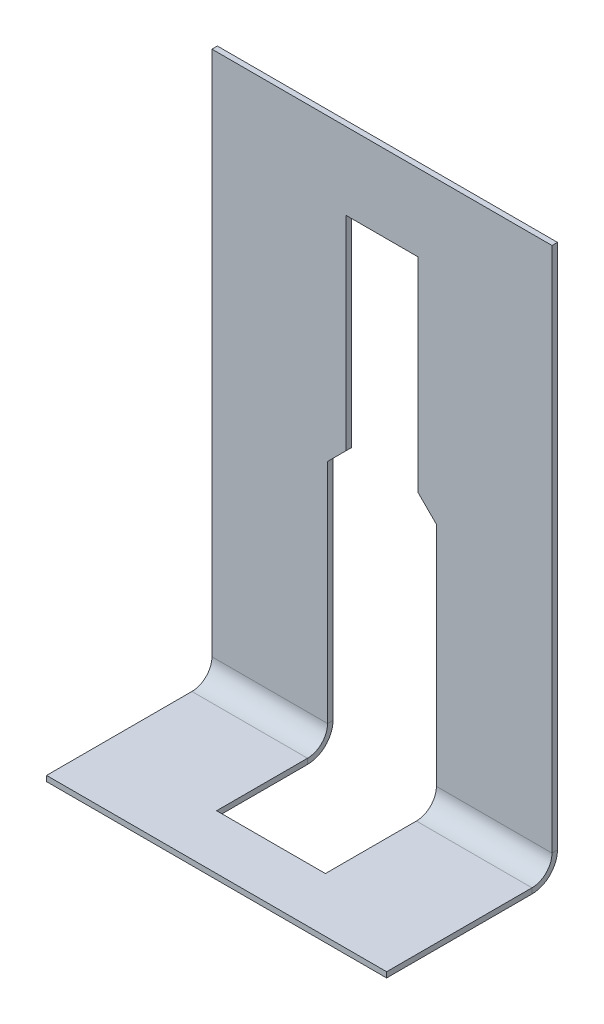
ISO-10303-21;
HEADER;
FILE_DESCRIPTION(('STEP AP214'),'2;1');
FILE_NAME('part.step','',(''),(''),'','','');
FILE_SCHEMA(('AUTOMOTIVE_DESIGN { 1 0 10303 214 1 1 1 1 }'));
ENDSEC;
DATA;
#1=APPLICATION_CONTEXT('core data for automotive mechanical design processes');
#2=APPLICATION_PROTOCOL_DEFINITION('international standard','automotive_design',2000,#1);
#3=PRODUCT_CONTEXT('',#1,'mechanical');
#4=PRODUCT('Part','Part','',(#3));
#5=PRODUCT_RELATED_PRODUCT_CATEGORY('part','',(#4));
#6=PRODUCT_DEFINITION_FORMATION('','',#4);
#7=PRODUCT_DEFINITION_CONTEXT('part definition',#1,'design');
#8=PRODUCT_DEFINITION('design','',#6,#7);
#9=PRODUCT_DEFINITION_SHAPE('','',#8);
#10=(LENGTH_UNIT() NAMED_UNIT(*) SI_UNIT(.MILLI.,.METRE.));
#11=(NAMED_UNIT(*) PLANE_ANGLE_UNIT() SI_UNIT($,.RADIAN.));
#12=(NAMED_UNIT(*) SI_UNIT($,.STERADIAN.) SOLID_ANGLE_UNIT());
#13=UNCERTAINTY_MEASURE_WITH_UNIT(LENGTH_MEASURE(1.E-05),#10,'distance_accuracy_value','');
#14=(GEOMETRIC_REPRESENTATION_CONTEXT(3) GLOBAL_UNCERTAINTY_ASSIGNED_CONTEXT((#13)) GLOBAL_UNIT_ASSIGNED_CONTEXT((#10,
#11,#12)) REPRESENTATION_CONTEXT('',''));
#15=CARTESIAN_POINT('',(0.,0.,0.));
#16=DIRECTION('',(0.,0.,1.));
#17=DIRECTION('',(1.,0.,0.));
#18=AXIS2_PLACEMENT_3D('',#15,#16,#17);
#19=CARTESIAN_POINT('',(-2.,-3.9204641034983,-3.17650737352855));
#20=DIRECTION('',(-1.,0.,0.));
#21=DIRECTION('',(0.,-1.,0.));
#22=AXIS2_PLACEMENT_3D('',#19,#20,#21);
#23=PLANE('',#22);
#24=DIRECTION('',(0.,-1.,0.));
#25=VECTOR('',#24,1.);
#26=CARTESIAN_POINT('',(-2.,-3.9204641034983,-2.97650737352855));
#27=LINE('',#26,#25);
#28=CARTESIAN_POINT('',(-2.,9.0795358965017,-2.9765073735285));
#29=VERTEX_POINT('',#28);
#30=CARTESIAN_POINT('',(-2.,0.736600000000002,-2.97650737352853));
#31=VERTEX_POINT('',#30);
#32=EDGE_CURVE('E85',#29,#31,#27,.T.);
#33=ORIENTED_EDGE('',*,*,#32,.T.);
#34=DIRECTION('',(0.,0.,-1.));
#35=VECTOR('',#34,1.);
#36=CARTESIAN_POINT('',(-2.,0.736600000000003,-3.17650737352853));
#37=LINE('',#36,#35);
#38=CARTESIAN_POINT('',(-2.,0.736600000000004,-3.17650737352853));
#39=VERTEX_POINT('',#38);
#40=EDGE_CURVE('E434',#31,#39,#37,.T.);
#41=ORIENTED_EDGE('',*,*,#40,.T.);
#42=DIRECTION('',(0.,-1.,0.));
#43=VECTOR('',#42,1.);
#44=CARTESIAN_POINT('',(-2.,9.0795358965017,-3.1765073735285));
#45=LINE('',#44,#43);
#46=CARTESIAN_POINT('',(-2.,9.0795358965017,-3.1765073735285));
#47=VERTEX_POINT('',#46);
#48=EDGE_CURVE('E379',#47,#39,#45,.T.);
#49=ORIENTED_EDGE('',*,*,#48,.F.);
#50=DIRECTION('',(0.,0.,1.));
#51=VECTOR('',#50,1.);
#52=CARTESIAN_POINT('',(-2.,9.0795358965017,-3.1765073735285));
#53=LINE('',#52,#51);
#54=EDGE_CURVE('E380',#47,#29,#53,.T.);
#55=ORIENTED_EDGE('',*,*,#54,.T.);
#56=EDGE_LOOP('',(#33,#41,#49,#55));
#57=FACE_BOUND('',#56,.T.);
#58=ADVANCED_FACE('F59',(#57),#23,.F.);
#59=CARTESIAN_POINT('',(0.,-2.81743558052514,-2.97650737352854));
#60=DIRECTION('',(0.,0.,-1.));
#61=DIRECTION('',(0.,1.,0.));
#62=AXIS2_PLACEMENT_3D('',#59,#60,#61);
#63=PLANE('',#62);
#64=DIRECTION('',(0.,-1.,0.));
#65=VECTOR('',#64,1.);
#66=CARTESIAN_POINT('',(-6.25,-5.9204641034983,-2.97650737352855));
#67=LINE('',#66,#65);
#68=CARTESIAN_POINT('',(-6.25,20.0795358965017,-2.97650737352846));
#69=VERTEX_POINT('',#68);
#70=CARTESIAN_POINT('',(-6.25,0.736600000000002,-2.97650737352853));
#71=VERTEX_POINT('',#70);
#72=EDGE_CURVE('E77',#69,#71,#67,.T.);
#73=ORIENTED_EDGE('',*,*,#72,.T.);
#74=DIRECTION('',(1.,0.,0.));
#75=VECTOR('',#74,1.);
#76=CARTESIAN_POINT('',(0.,0.736600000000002,-2.97650737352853));
#77=LINE('',#76,#75);
#78=EDGE_CURVE('E69',#71,#31,#77,.T.);
#79=ORIENTED_EDGE('',*,*,#78,.T.);
#80=ORIENTED_EDGE('',*,*,#32,.F.);
#81=DIRECTION('',(-0.707106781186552,-0.707106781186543,0.));
#82=VECTOR('',#81,1.);
#83=CARTESIAN_POINT('',(-2.,9.0795358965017,-2.9765073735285));
#84=LINE('',#83,#82);
#85=CARTESIAN_POINT('',(-1.32574419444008,9.75379170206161,-2.9765073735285));
#86=VERTEX_POINT('',#85);
#87=EDGE_CURVE('E376',#86,#29,#84,.T.);
#88=ORIENTED_EDGE('',*,*,#87,.F.);
#89=DIRECTION('',(0.,-1.,0.));
#90=VECTOR('',#89,1.);
#91=CARTESIAN_POINT('',(-1.32574419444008,9.75379170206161,-2.9765073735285));
#92=LINE('',#91,#90);
#93=CARTESIAN_POINT('',(-1.32574419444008,17.2537917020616,-2.97650737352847));
#94=VERTEX_POINT('',#93);
#95=EDGE_CURVE('E372',#94,#86,#92,.T.);
#96=ORIENTED_EDGE('',*,*,#95,.F.);
#97=DIRECTION('',(-1.,0.,0.));
#98=VECTOR('',#97,1.);
#99=CARTESIAN_POINT('',(-1.32574419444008,17.2537917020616,-2.97650737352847));
#100=LINE('',#99,#98);
#101=CARTESIAN_POINT('',(1.32574419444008,17.2537917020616,-2.97650737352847));
#102=VERTEX_POINT('',#101);
#103=EDGE_CURVE('E368',#102,#94,#100,.T.);
#104=ORIENTED_EDGE('',*,*,#103,.F.);
#105=DIRECTION('',(0.,1.,0.));
#106=VECTOR('',#105,1.);
#107=CARTESIAN_POINT('',(1.32574419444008,17.2537917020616,-2.97650737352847));
#108=LINE('',#107,#106);
#109=CARTESIAN_POINT('',(1.32574419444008,9.75379170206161,-2.9765073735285));
#110=VERTEX_POINT('',#109);
#111=EDGE_CURVE('E363',#110,#102,#108,.T.);
#112=ORIENTED_EDGE('',*,*,#111,.F.);
#113=DIRECTION('',(-0.707106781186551,0.707106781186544,0.));
#114=VECTOR('',#113,1.);
#115=CARTESIAN_POINT('',(2.,9.0795358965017,-2.9765073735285));
#116=LINE('',#115,#114);
#117=CARTESIAN_POINT('',(2.,9.0795358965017,-2.9765073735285));
#118=VERTEX_POINT('',#117);
#119=EDGE_CURVE('E359',#118,#110,#116,.T.);
#120=ORIENTED_EDGE('',*,*,#119,.F.);
#121=DIRECTION('',(0.,1.,0.));
#122=VECTOR('',#121,1.);
#123=CARTESIAN_POINT('',(2.,9.0795358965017,-2.9765073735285));
#124=LINE('',#123,#122);
#125=CARTESIAN_POINT('',(2.,0.736600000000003,-2.97650737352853));
#126=VERTEX_POINT('',#125);
#127=EDGE_CURVE('E364',#126,#118,#124,.T.);
#128=ORIENTED_EDGE('',*,*,#127,.F.);
#129=DIRECTION('',(1.,0.,0.));
#130=VECTOR('',#129,1.);
#131=CARTESIAN_POINT('',(0.,0.736600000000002,-2.97650737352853));
#132=LINE('',#131,#130);
#133=CARTESIAN_POINT('',(6.25,0.736600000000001,-2.97650737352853));
#134=VERTEX_POINT('',#133);
#135=EDGE_CURVE('E424',#126,#134,#132,.T.);
#136=ORIENTED_EDGE('',*,*,#135,.T.);
#137=DIRECTION('',(0.,1.,0.));
#138=VECTOR('',#137,1.);
#139=CARTESIAN_POINT('',(6.24999999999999,20.0795358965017,-2.97650737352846));
#140=LINE('',#139,#138);
#141=CARTESIAN_POINT('',(6.24999999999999,20.0795358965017,-2.97650737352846));
#142=VERTEX_POINT('',#141);
#143=EDGE_CURVE('E408',#134,#142,#140,.T.);
#144=ORIENTED_EDGE('',*,*,#143,.T.);
#145=DIRECTION('',(-1.,0.,0.));
#146=VECTOR('',#145,1.);
#147=CARTESIAN_POINT('',(-6.25,20.0795358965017,-2.97650737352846));
#148=LINE('',#147,#146);
#149=EDGE_CURVE('E404',#142,#69,#148,.T.);
#150=ORIENTED_EDGE('',*,*,#149,.T.);
#151=EDGE_LOOP('',(#73,#79,#80,#88,#96,#104,#112,#120,#128,#136,#144,#150));
#152=FACE_BOUND('',#151,.T.);
#153=ADVANCED_FACE('F474',(#152),#63,.F.);
#154=CARTESIAN_POINT('',(0.,-2.81743558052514,-3.17650737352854));
#155=DIRECTION('',(0.,0.,-1.));
#156=DIRECTION('',(0.,1.,0.));
#157=AXIS2_PLACEMENT_3D('',#154,#155,#156);
#158=PLANE('',#157);
#159=DIRECTION('',(1.,0.,0.));
#160=VECTOR('',#159,1.);
#161=CARTESIAN_POINT('',(0.,0.736600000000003,-3.17650737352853));
#162=LINE('',#161,#160);
#163=CARTESIAN_POINT('',(-6.25,0.736600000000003,-3.17650737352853));
#164=VERTEX_POINT('',#163);
#165=EDGE_CURVE('E240',#164,#39,#162,.T.);
#166=ORIENTED_EDGE('',*,*,#165,.F.);
#167=DIRECTION('',(0.,-1.,0.));
#168=VECTOR('',#167,1.);
#169=CARTESIAN_POINT('',(-6.25,0.0795358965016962,-3.17650737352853));
#170=LINE('',#169,#168);
#171=CARTESIAN_POINT('',(-6.25,20.0795358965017,-3.17650737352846));
#172=VERTEX_POINT('',#171);
#173=EDGE_CURVE('E407',#172,#164,#170,.T.);
#174=ORIENTED_EDGE('',*,*,#173,.F.);
#175=DIRECTION('',(-1.,0.,0.));
#176=VECTOR('',#175,1.);
#177=CARTESIAN_POINT('',(-6.25,20.0795358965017,-3.17650737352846));
#178=LINE('',#177,#176);
#179=CARTESIAN_POINT('',(6.24999999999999,20.0795358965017,-3.17650737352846));
#180=VERTEX_POINT('',#179);
#181=EDGE_CURVE('E398',#180,#172,#178,.T.);
#182=ORIENTED_EDGE('',*,*,#181,.F.);
#183=DIRECTION('',(0.,1.,0.));
#184=VECTOR('',#183,1.);
#185=CARTESIAN_POINT('',(6.25,-5.9204641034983,-3.17650737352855));
#186=LINE('',#185,#184);
#187=CARTESIAN_POINT('',(6.25,0.736600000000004,-3.17650737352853));
#188=VERTEX_POINT('',#187);
#189=EDGE_CURVE('E403',#188,#180,#186,.T.);
#190=ORIENTED_EDGE('',*,*,#189,.F.);
#191=DIRECTION('',(1.,0.,0.));
#192=VECTOR('',#191,1.);
#193=CARTESIAN_POINT('',(0.,0.736600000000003,-3.17650737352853));
#194=LINE('',#193,#192);
#195=CARTESIAN_POINT('',(2.,0.736600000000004,-3.17650737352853));
#196=VERTEX_POINT('',#195);
#197=EDGE_CURVE('E413',#196,#188,#194,.T.);
#198=ORIENTED_EDGE('',*,*,#197,.F.);
#199=DIRECTION('',(0.,1.,0.));
#200=VECTOR('',#199,1.);
#201=CARTESIAN_POINT('',(2.,-3.9204641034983,-3.17650737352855));
#202=LINE('',#201,#200);
#203=CARTESIAN_POINT('',(2.,9.0795358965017,-3.1765073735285));
#204=VERTEX_POINT('',#203);
#205=EDGE_CURVE('E63',#196,#204,#202,.T.);
#206=ORIENTED_EDGE('',*,*,#205,.T.);
#207=DIRECTION('',(-0.707106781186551,0.707106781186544,0.));
#208=VECTOR('',#207,1.);
#209=CARTESIAN_POINT('',(2.,9.0795358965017,-3.1765073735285));
#210=LINE('',#209,#208);
#211=CARTESIAN_POINT('',(1.32574419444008,9.75379170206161,-3.1765073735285));
#212=VERTEX_POINT('',#211);
#213=EDGE_CURVE('E338',#204,#212,#210,.T.);
#214=ORIENTED_EDGE('',*,*,#213,.T.);
#215=DIRECTION('',(0.,1.,0.));
#216=VECTOR('',#215,1.);
#217=CARTESIAN_POINT('',(1.32574419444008,17.2537917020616,-3.17650737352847));
#218=LINE('',#217,#216);
#219=CARTESIAN_POINT('',(1.32574419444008,17.2537917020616,-3.17650737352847));
#220=VERTEX_POINT('',#219);
#221=EDGE_CURVE('E342',#212,#220,#218,.T.);
#222=ORIENTED_EDGE('',*,*,#221,.T.);
#223=DIRECTION('',(-1.,0.,0.));
#224=VECTOR('',#223,1.);
#225=CARTESIAN_POINT('',(-1.32574419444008,17.2537917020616,-3.17650737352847));
#226=LINE('',#225,#224);
#227=CARTESIAN_POINT('',(-1.32574419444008,17.2537917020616,-3.17650737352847));
#228=VERTEX_POINT('',#227);
#229=EDGE_CURVE('E346',#220,#228,#226,.T.);
#230=ORIENTED_EDGE('',*,*,#229,.T.);
#231=DIRECTION('',(0.,-1.,0.));
#232=VECTOR('',#231,1.);
#233=CARTESIAN_POINT('',(-1.32574419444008,9.75379170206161,-3.1765073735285));
#234=LINE('',#233,#232);
#235=CARTESIAN_POINT('',(-1.32574419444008,9.75379170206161,-3.1765073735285));
#236=VERTEX_POINT('',#235);
#237=EDGE_CURVE('E350',#228,#236,#234,.T.);
#238=ORIENTED_EDGE('',*,*,#237,.T.);
#239=DIRECTION('',(-0.707106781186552,-0.707106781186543,0.));
#240=VECTOR('',#239,1.);
#241=CARTESIAN_POINT('',(-2.,9.0795358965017,-3.1765073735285));
#242=LINE('',#241,#240);
#243=EDGE_CURVE('E354',#236,#47,#242,.T.);
#244=ORIENTED_EDGE('',*,*,#243,.T.);
#245=ORIENTED_EDGE('',*,*,#48,.T.);
#246=EDGE_LOOP('',(#166,#174,#182,#190,#198,#206,#214,#222,#230,#238,#244,#245));
#247=FACE_BOUND('',#246,.T.);
#248=ADVANCED_FACE('F463',(#247),#158,.T.);
#249=CARTESIAN_POINT('',(2.,9.0795358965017,-3.1765073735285));
#250=DIRECTION('',(1.,0.,0.));
#251=DIRECTION('',(0.,1.,0.));
#252=AXIS2_PLACEMENT_3D('',#249,#250,#251);
#253=PLANE('',#252);
#254=ORIENTED_EDGE('',*,*,#205,.F.);
#255=DIRECTION('',(0.,0.,1.));
#256=VECTOR('',#255,1.);
#257=CARTESIAN_POINT('',(2.,0.736600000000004,-3.17650737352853));
#258=LINE('',#257,#256);
#259=EDGE_CURVE('E428',#196,#126,#258,.T.);
#260=ORIENTED_EDGE('',*,*,#259,.T.);
#261=ORIENTED_EDGE('',*,*,#127,.T.);
#262=DIRECTION('',(0.,0.,1.));
#263=VECTOR('',#262,1.);
#264=CARTESIAN_POINT('',(2.,9.0795358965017,-3.1765073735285));
#265=LINE('',#264,#263);
#266=EDGE_CURVE('E358',#204,#118,#265,.T.);
#267=ORIENTED_EDGE('',*,*,#266,.F.);
#268=EDGE_LOOP('',(#254,#260,#261,#267));
#269=FACE_BOUND('',#268,.T.);
#270=ADVANCED_FACE('F61',(#269),#253,.F.);
#271=CARTESIAN_POINT('',(-6.25,20.0795358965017,-3.17650737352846));
#272=DIRECTION('',(0.,1.,0.));
#273=DIRECTION('',(-1.,0.,0.));
#274=AXIS2_PLACEMENT_3D('',#271,#272,#273);
#275=PLANE('',#274);
#276=ORIENTED_EDGE('',*,*,#149,.F.);
#277=DIRECTION('',(0.,0.,1.));
#278=VECTOR('',#277,1.);
#279=CARTESIAN_POINT('',(6.24999999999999,20.0795358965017,-3.17650737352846));
#280=LINE('',#279,#278);
#281=EDGE_CURVE('E402',#180,#142,#280,.T.);
#282=ORIENTED_EDGE('',*,*,#281,.F.);
#283=ORIENTED_EDGE('',*,*,#181,.T.);
#284=DIRECTION('',(0.,0.,1.));
#285=VECTOR('',#284,1.);
#286=CARTESIAN_POINT('',(-6.25,20.0795358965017,-3.17650737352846));
#287=LINE('',#286,#285);
#288=EDGE_CURVE('E409',#172,#69,#287,.T.);
#289=ORIENTED_EDGE('',*,*,#288,.T.);
#290=EDGE_LOOP('',(#276,#282,#283,#289));
#291=FACE_BOUND('',#290,.T.);
#292=ADVANCED_FACE('F461',(#291),#275,.T.);
#293=CARTESIAN_POINT('',(6.24999999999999,20.0795358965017,-3.17650737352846));
#294=DIRECTION('',(1.,0.,0.));
#295=DIRECTION('',(0.,1.,0.));
#296=AXIS2_PLACEMENT_3D('',#293,#294,#295);
#297=PLANE('',#296);
#298=DIRECTION('',(0.,0.,1.));
#299=VECTOR('',#298,1.);
#300=CARTESIAN_POINT('',(6.25,0.736600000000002,-3.17650737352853));
#301=LINE('',#300,#299);
#302=EDGE_CURVE('E420',#188,#134,#301,.T.);
#303=ORIENTED_EDGE('',*,*,#302,.F.);
#304=ORIENTED_EDGE('',*,*,#189,.T.);
#305=ORIENTED_EDGE('',*,*,#281,.T.);
#306=ORIENTED_EDGE('',*,*,#143,.F.);
#307=EDGE_LOOP('',(#303,#304,#305,#306));
#308=FACE_BOUND('',#307,.T.);
#309=ADVANCED_FACE('F456',(#308),#297,.T.);
#310=CARTESIAN_POINT('',(-6.25,-5.9204641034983,-3.17650737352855));
#311=DIRECTION('',(-1.,0.,0.));
#312=DIRECTION('',(0.,-1.,0.));
#313=AXIS2_PLACEMENT_3D('',#310,#311,#312);
#314=PLANE('',#313);
#315=DIRECTION('',(0.,0.,-1.));
#316=VECTOR('',#315,1.);
#317=CARTESIAN_POINT('',(-6.25,0.736600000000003,-3.17650737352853));
#318=LINE('',#317,#316);
#319=EDGE_CURVE('E12',#71,#164,#318,.T.);
#320=ORIENTED_EDGE('',*,*,#319,.F.);
#321=ORIENTED_EDGE('',*,*,#72,.F.);
#322=ORIENTED_EDGE('',*,*,#288,.F.);
#323=ORIENTED_EDGE('',*,*,#173,.T.);
#324=EDGE_LOOP('',(#320,#321,#322,#323));
#325=FACE_BOUND('',#324,.T.);
#326=ADVANCED_FACE('F465',(#325),#314,.T.);
#327=CARTESIAN_POINT('',(-2.,9.0795358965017,-3.1765073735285));
#328=DIRECTION('',(-0.707106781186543,0.707106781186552,0.));
#329=DIRECTION('',(-0.707106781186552,-0.707106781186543,0.));
#330=AXIS2_PLACEMENT_3D('',#327,#328,#329);
#331=PLANE('',#330);
#332=ORIENTED_EDGE('',*,*,#87,.T.);
#333=ORIENTED_EDGE('',*,*,#54,.F.);
#334=ORIENTED_EDGE('',*,*,#243,.F.);
#335=DIRECTION('',(0.,0.,1.));
#336=VECTOR('',#335,1.);
#337=CARTESIAN_POINT('',(-1.32574419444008,9.75379170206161,-3.1765073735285));
#338=LINE('',#337,#336);
#339=EDGE_CURVE('E383',#236,#86,#338,.T.);
#340=ORIENTED_EDGE('',*,*,#339,.T.);
#341=EDGE_LOOP('',(#332,#333,#334,#340));
#342=FACE_BOUND('',#341,.T.);
#343=ADVANCED_FACE('F480',(#342),#331,.F.);
#344=CARTESIAN_POINT('',(-1.32574419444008,9.75379170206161,-3.1765073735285));
#345=DIRECTION('',(-1.,0.,0.));
#346=DIRECTION('',(0.,-1.,0.));
#347=AXIS2_PLACEMENT_3D('',#344,#345,#346);
#348=PLANE('',#347);
#349=ORIENTED_EDGE('',*,*,#95,.T.);
#350=ORIENTED_EDGE('',*,*,#339,.F.);
#351=ORIENTED_EDGE('',*,*,#237,.F.);
#352=DIRECTION('',(0.,0.,1.));
#353=VECTOR('',#352,1.);
#354=CARTESIAN_POINT('',(-1.32574419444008,17.2537917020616,-3.17650737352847));
#355=LINE('',#354,#353);
#356=EDGE_CURVE('E386',#228,#94,#355,.T.);
#357=ORIENTED_EDGE('',*,*,#356,.T.);
#358=EDGE_LOOP('',(#349,#350,#351,#357));
#359=FACE_BOUND('',#358,.T.);
#360=ADVANCED_FACE('F485',(#359),#348,.F.);
#361=CARTESIAN_POINT('',(-1.32574419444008,17.2537917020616,-3.17650737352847));
#362=DIRECTION('',(0.,1.,0.));
#363=DIRECTION('',(-1.,0.,0.));
#364=AXIS2_PLACEMENT_3D('',#361,#362,#363);
#365=PLANE('',#364);
#366=ORIENTED_EDGE('',*,*,#103,.T.);
#367=ORIENTED_EDGE('',*,*,#356,.F.);
#368=ORIENTED_EDGE('',*,*,#229,.F.);
#369=DIRECTION('',(0.,0.,1.));
#370=VECTOR('',#369,1.);
#371=CARTESIAN_POINT('',(1.32574419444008,17.2537917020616,-3.17650737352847));
#372=LINE('',#371,#370);
#373=EDGE_CURVE('E389',#220,#102,#372,.T.);
#374=ORIENTED_EDGE('',*,*,#373,.T.);
#375=EDGE_LOOP('',(#366,#367,#368,#374));
#376=FACE_BOUND('',#375,.T.);
#377=ADVANCED_FACE('F488',(#376),#365,.F.);
#378=CARTESIAN_POINT('',(1.32574419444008,17.2537917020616,-3.17650737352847));
#379=DIRECTION('',(1.,0.,0.));
#380=DIRECTION('',(0.,1.,0.));
#381=AXIS2_PLACEMENT_3D('',#378,#379,#380);
#382=PLANE('',#381);
#383=ORIENTED_EDGE('',*,*,#111,.T.);
#384=ORIENTED_EDGE('',*,*,#373,.F.);
#385=ORIENTED_EDGE('',*,*,#221,.F.);
#386=DIRECTION('',(0.,0.,1.));
#387=VECTOR('',#386,1.);
#388=CARTESIAN_POINT('',(1.32574419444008,9.75379170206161,-3.1765073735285));
#389=LINE('',#388,#387);
#390=EDGE_CURVE('E392',#212,#110,#389,.T.);
#391=ORIENTED_EDGE('',*,*,#390,.T.);
#392=EDGE_LOOP('',(#383,#384,#385,#391));
#393=FACE_BOUND('',#392,.T.);
#394=ADVANCED_FACE('F491',(#393),#382,.F.);
#395=CARTESIAN_POINT('',(2.,9.0795358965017,-3.1765073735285));
#396=DIRECTION('',(0.707106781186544,0.707106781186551,0.));
#397=DIRECTION('',(-0.707106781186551,0.707106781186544,0.));
#398=AXIS2_PLACEMENT_3D('',#395,#396,#397);
#399=PLANE('',#398);
#400=ORIENTED_EDGE('',*,*,#119,.T.);
#401=ORIENTED_EDGE('',*,*,#390,.F.);
#402=ORIENTED_EDGE('',*,*,#213,.F.);
#403=ORIENTED_EDGE('',*,*,#266,.T.);
#404=EDGE_LOOP('',(#400,#401,#402,#403));
#405=FACE_BOUND('',#404,.T.);
#406=ADVANCED_FACE('F494',(#405),#399,.F.);
#407=CARTESIAN_POINT('',(6.25,-0.2,3.10302852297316));
#408=DIRECTION('',(0.,0.,1.));
#409=DIRECTION('',(1.,0.,0.));
#410=AXIS2_PLACEMENT_3D('',#407,#408,#409);
#411=PLANE('',#410);
#412=DIRECTION('',(1.,0.,0.));
#413=VECTOR('',#412,1.);
#414=CARTESIAN_POINT('',(6.25,0.,3.10302852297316));
#415=LINE('',#414,#413);
#416=CARTESIAN_POINT('',(-6.25,0.,3.10302852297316));
#417=VERTEX_POINT('',#416);
#418=CARTESIAN_POINT('',(6.25,0.,3.10302852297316));
#419=VERTEX_POINT('',#418);
#420=EDGE_CURVE('E291',#417,#419,#415,.T.);
#421=ORIENTED_EDGE('',*,*,#420,.F.);
#422=DIRECTION('',(0.,1.,0.));
#423=VECTOR('',#422,1.);
#424=CARTESIAN_POINT('',(-6.25,-0.2,3.10302852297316));
#425=LINE('',#424,#423);
#426=CARTESIAN_POINT('',(-6.25,-0.2,3.10302852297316));
#427=VERTEX_POINT('',#426);
#428=EDGE_CURVE('E268',#427,#417,#425,.T.);
#429=ORIENTED_EDGE('',*,*,#428,.F.);
#430=DIRECTION('',(1.,0.,0.));
#431=VECTOR('',#430,1.);
#432=CARTESIAN_POINT('',(6.25,-0.2,3.10302852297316));
#433=LINE('',#432,#431);
#434=CARTESIAN_POINT('',(6.25,-0.2,3.10302852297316));
#435=VERTEX_POINT('',#434);
#436=EDGE_CURVE('E326',#427,#435,#433,.T.);
#437=ORIENTED_EDGE('',*,*,#436,.T.);
#438=DIRECTION('',(0.,1.,0.));
#439=VECTOR('',#438,1.);
#440=CARTESIAN_POINT('',(6.25,-0.2,3.10302852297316));
#441=LINE('',#440,#439);
#442=EDGE_CURVE('E322',#435,#419,#441,.T.);
#443=ORIENTED_EDGE('',*,*,#442,.T.);
#444=EDGE_LOOP('',(#421,#429,#437,#443));
#445=FACE_BOUND('',#444,.T.);
#446=ADVANCED_FACE('F532',(#445),#411,.T.);
#447=CARTESIAN_POINT('',(2.,-0.2,1.10302852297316));
#448=DIRECTION('',(0.,0.,1.));
#449=DIRECTION('',(1.,0.,0.));
#450=AXIS2_PLACEMENT_3D('',#447,#448,#449);
#451=PLANE('',#450);
#452=DIRECTION('',(1.,0.,0.));
#453=VECTOR('',#452,1.);
#454=CARTESIAN_POINT('',(2.,0.,1.10302852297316));
#455=LINE('',#454,#453);
#456=CARTESIAN_POINT('',(-2.,0.,1.10302852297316));
#457=VERTEX_POINT('',#456);
#458=CARTESIAN_POINT('',(2.,0.,1.10302852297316));
#459=VERTEX_POINT('',#458);
#460=EDGE_CURVE('E318',#457,#459,#455,.T.);
#461=ORIENTED_EDGE('',*,*,#460,.T.);
#462=DIRECTION('',(0.,1.,0.));
#463=VECTOR('',#462,1.);
#464=CARTESIAN_POINT('',(2.,-0.2,1.10302852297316));
#465=LINE('',#464,#463);
#466=CARTESIAN_POINT('',(2.,-0.2,1.10302852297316));
#467=VERTEX_POINT('',#466);
#468=EDGE_CURVE('E284',#467,#459,#465,.T.);
#469=ORIENTED_EDGE('',*,*,#468,.F.);
#470=DIRECTION('',(1.,0.,0.));
#471=VECTOR('',#470,1.);
#472=CARTESIAN_POINT('',(2.,-0.2,1.10302852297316));
#473=LINE('',#472,#471);
#474=CARTESIAN_POINT('',(-2.,-0.2,1.10302852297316));
#475=VERTEX_POINT('',#474);
#476=EDGE_CURVE('E212',#475,#467,#473,.T.);
#477=ORIENTED_EDGE('',*,*,#476,.F.);
#478=DIRECTION('',(0.,1.,0.));
#479=VECTOR('',#478,1.);
#480=CARTESIAN_POINT('',(-2.,-0.2,1.10302852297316));
#481=LINE('',#480,#479);
#482=EDGE_CURVE('E207',#475,#457,#481,.T.);
#483=ORIENTED_EDGE('',*,*,#482,.T.);
#484=EDGE_LOOP('',(#461,#469,#477,#483));
#485=FACE_BOUND('',#484,.T.);
#486=ADVANCED_FACE('F527',(#485),#451,.F.);
#487=CARTESIAN_POINT('',(0.,-0.2,0.));
#488=DIRECTION('',(0.,-1.,0.));
#489=DIRECTION('',(0.,0.,-1.));
#490=AXIS2_PLACEMENT_3D('',#487,#488,#489);
#491=PLANE('',#490);
#492=DIRECTION('',(0.,0.,1.));
#493=VECTOR('',#492,1.);
#494=CARTESIAN_POINT('',(-6.25,-0.2,-2.89697147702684));
#495=LINE('',#494,#493);
#496=CARTESIAN_POINT('',(-6.25,-0.2,-2.23990737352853));
#497=VERTEX_POINT('',#496);
#498=EDGE_CURVE('E218',#497,#427,#495,.T.);
#499=ORIENTED_EDGE('',*,*,#498,.F.);
#500=DIRECTION('',(1.,0.,0.));
#501=VECTOR('',#500,1.);
#502=CARTESIAN_POINT('',(0.,-0.2,-2.23990737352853));
#503=LINE('',#502,#501);
#504=CARTESIAN_POINT('',(-2.,-0.2,-2.23990737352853));
#505=VERTEX_POINT('',#504);
#506=EDGE_CURVE('E213',#497,#505,#503,.T.);
#507=ORIENTED_EDGE('',*,*,#506,.T.);
#508=DIRECTION('',(0.,0.,1.));
#509=VECTOR('',#508,1.);
#510=CARTESIAN_POINT('',(-2.,-0.2,-11.8969714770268));
#511=LINE('',#510,#509);
#512=EDGE_CURVE('E200',#505,#475,#511,.T.);
#513=ORIENTED_EDGE('',*,*,#512,.T.);
#514=ORIENTED_EDGE('',*,*,#476,.T.);
#515=DIRECTION('',(0.,0.,-1.));
#516=VECTOR('',#515,1.);
#517=CARTESIAN_POINT('',(2.,-0.2,1.10302852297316));
#518=LINE('',#517,#516);
#519=CARTESIAN_POINT('',(2.,-0.2,-2.23990737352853));
#520=VERTEX_POINT('',#519);
#521=EDGE_CURVE('E310',#467,#520,#518,.T.);
#522=ORIENTED_EDGE('',*,*,#521,.T.);
#523=DIRECTION('',(1.,0.,0.));
#524=VECTOR('',#523,1.);
#525=CARTESIAN_POINT('',(0.,-0.2,-2.23990737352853));
#526=LINE('',#525,#524);
#527=CARTESIAN_POINT('',(6.25,-0.2,-2.23990737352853));
#528=VERTEX_POINT('',#527);
#529=EDGE_CURVE('E306',#520,#528,#526,.T.);
#530=ORIENTED_EDGE('',*,*,#529,.T.);
#531=DIRECTION('',(0.,0.,-1.));
#532=VECTOR('',#531,1.);
#533=CARTESIAN_POINT('',(6.25,-0.2,3.10302852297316));
#534=LINE('',#533,#532);
#535=EDGE_CURVE('E302',#435,#528,#534,.T.);
#536=ORIENTED_EDGE('',*,*,#535,.F.);
#537=ORIENTED_EDGE('',*,*,#436,.F.);
#538=EDGE_LOOP('',(#499,#507,#513,#514,#522,#530,#536,#537));
#539=FACE_BOUND('',#538,.T.);
#540=ADVANCED_FACE('F216',(#539),#491,.T.);
#541=CARTESIAN_POINT('',(6.24999999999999,-0.2,-22.8969714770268));
#542=DIRECTION('',(1.,0.,0.));
#543=DIRECTION('',(0.,0.,-1.));
#544=AXIS2_PLACEMENT_3D('',#541,#542,#543);
#545=PLANE('',#544);
#546=ORIENTED_EDGE('',*,*,#535,.T.);
#547=DIRECTION('',(0.,1.,0.));
#548=VECTOR('',#547,1.);
#549=CARTESIAN_POINT('',(6.25,-0.199999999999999,-2.23990737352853));
#550=LINE('',#549,#548);
#551=CARTESIAN_POINT('',(6.25,0.,-2.23990737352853));
#552=VERTEX_POINT('',#551);
#553=EDGE_CURVE('E298',#528,#552,#550,.T.);
#554=ORIENTED_EDGE('',*,*,#553,.T.);
#555=DIRECTION('',(0.,0.,-1.));
#556=VECTOR('',#555,1.);
#557=CARTESIAN_POINT('',(6.24999999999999,0.,-22.8969714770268));
#558=LINE('',#557,#556);
#559=EDGE_CURVE('E287',#419,#552,#558,.T.);
#560=ORIENTED_EDGE('',*,*,#559,.F.);
#561=ORIENTED_EDGE('',*,*,#442,.F.);
#562=EDGE_LOOP('',(#546,#554,#560,#561));
#563=FACE_BOUND('',#562,.T.);
#564=ADVANCED_FACE('F519',(#563),#545,.T.);
#565=CARTESIAN_POINT('',(0.,0.,0.));
#566=DIRECTION('',(0.,-1.,0.));
#567=DIRECTION('',(0.,0.,-1.));
#568=AXIS2_PLACEMENT_3D('',#565,#566,#567);
#569=PLANE('',#568);
#570=DIRECTION('',(1.,0.,0.));
#571=VECTOR('',#570,1.);
#572=CARTESIAN_POINT('',(0.,0.,-2.23990737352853));
#573=LINE('',#572,#571);
#574=CARTESIAN_POINT('',(-6.25,0.,-2.23990737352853));
#575=VERTEX_POINT('',#574);
#576=CARTESIAN_POINT('',(-2.,0.,-2.23990737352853));
#577=VERTEX_POINT('',#576);
#578=EDGE_CURVE('E236',#575,#577,#573,.T.);
#579=ORIENTED_EDGE('',*,*,#578,.F.);
#580=DIRECTION('',(0.,0.,1.));
#581=VECTOR('',#580,1.);
#582=CARTESIAN_POINT('',(-6.25,0.,3.10302852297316));
#583=LINE('',#582,#581);
#584=EDGE_CURVE('E295',#575,#417,#583,.T.);
#585=ORIENTED_EDGE('',*,*,#584,.T.);
#586=ORIENTED_EDGE('',*,*,#420,.T.);
#587=ORIENTED_EDGE('',*,*,#559,.T.);
#588=DIRECTION('',(1.,0.,0.));
#589=VECTOR('',#588,1.);
#590=CARTESIAN_POINT('',(0.,0.,-2.23990737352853));
#591=LINE('',#590,#589);
#592=CARTESIAN_POINT('',(2.,0.,-2.23990737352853));
#593=VERTEX_POINT('',#592);
#594=EDGE_CURVE('E330',#593,#552,#591,.T.);
#595=ORIENTED_EDGE('',*,*,#594,.F.);
#596=DIRECTION('',(0.,0.,-1.));
#597=VECTOR('',#596,1.);
#598=CARTESIAN_POINT('',(2.,0.,-11.8969714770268));
#599=LINE('',#598,#597);
#600=EDGE_CURVE('E280',#459,#593,#599,.T.);
#601=ORIENTED_EDGE('',*,*,#600,.F.);
#602=ORIENTED_EDGE('',*,*,#460,.F.);
#603=DIRECTION('',(0.,0.,1.));
#604=VECTOR('',#603,1.);
#605=CARTESIAN_POINT('',(-2.,0.,1.10302852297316));
#606=LINE('',#605,#604);
#607=EDGE_CURVE('E277',#577,#457,#606,.T.);
#608=ORIENTED_EDGE('',*,*,#607,.F.);
#609=EDGE_LOOP('',(#579,#585,#586,#587,#595,#601,#602,#608));
#610=FACE_BOUND('',#609,.T.);
#611=ADVANCED_FACE('F516',(#610),#569,.F.);
#612=CARTESIAN_POINT('',(2.,-0.2,-11.8969714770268));
#613=DIRECTION('',(1.,0.,0.));
#614=DIRECTION('',(0.,0.,-1.));
#615=AXIS2_PLACEMENT_3D('',#612,#613,#614);
#616=PLANE('',#615);
#617=DIRECTION('',(0.,1.,0.));
#618=VECTOR('',#617,1.);
#619=CARTESIAN_POINT('',(2.,-0.199999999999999,-2.23990737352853));
#620=LINE('',#619,#618);
#621=EDGE_CURVE('E235',#520,#593,#620,.T.);
#622=ORIENTED_EDGE('',*,*,#621,.F.);
#623=ORIENTED_EDGE('',*,*,#521,.F.);
#624=ORIENTED_EDGE('',*,*,#468,.T.);
#625=ORIENTED_EDGE('',*,*,#600,.T.);
#626=EDGE_LOOP('',(#622,#623,#624,#625));
#627=FACE_BOUND('',#626,.T.);
#628=ADVANCED_FACE('F511',(#627),#616,.F.);
#629=CARTESIAN_POINT('',(-2.,-0.2,1.10302852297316));
#630=DIRECTION('',(-1.,0.,0.));
#631=DIRECTION('',(0.,0.,1.));
#632=AXIS2_PLACEMENT_3D('',#629,#630,#631);
#633=PLANE('',#632);
#634=DIRECTION('',(0.,-1.,0.));
#635=VECTOR('',#634,1.);
#636=CARTESIAN_POINT('',(-2.,-0.2,-2.23990737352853));
#637=LINE('',#636,#635);
#638=EDGE_CURVE('E204',#577,#505,#637,.T.);
#639=ORIENTED_EDGE('',*,*,#638,.F.);
#640=ORIENTED_EDGE('',*,*,#607,.T.);
#641=ORIENTED_EDGE('',*,*,#482,.F.);
#642=ORIENTED_EDGE('',*,*,#512,.F.);
#643=EDGE_LOOP('',(#639,#640,#641,#642));
#644=FACE_BOUND('',#643,.T.);
#645=ADVANCED_FACE('F202',(#644),#633,.F.);
#646=CARTESIAN_POINT('',(-6.25,-0.2,3.10302852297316));
#647=DIRECTION('',(-1.,0.,0.));
#648=DIRECTION('',(0.,0.,1.));
#649=AXIS2_PLACEMENT_3D('',#646,#647,#648);
#650=PLANE('',#649);
#651=ORIENTED_EDGE('',*,*,#584,.F.);
#652=DIRECTION('',(0.,-1.,0.));
#653=VECTOR('',#652,1.);
#654=CARTESIAN_POINT('',(-6.25,-0.2,-2.23990737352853));
#655=LINE('',#654,#653);
#656=EDGE_CURVE('E274',#575,#497,#655,.T.);
#657=ORIENTED_EDGE('',*,*,#656,.T.);
#658=ORIENTED_EDGE('',*,*,#498,.T.);
#659=ORIENTED_EDGE('',*,*,#428,.T.);
#660=EDGE_LOOP('',(#651,#657,#658,#659));
#661=FACE_BOUND('',#660,.T.);
#662=ADVANCED_FACE('F530',(#661),#650,.T.);
#663=CARTESIAN_POINT('',(2.,0.7366,-2.23990737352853));
#664=DIRECTION('',(-1.,0.,0.));
#665=DIRECTION('',(0.,0.,1.));
#666=AXIS2_PLACEMENT_3D('',#663,#664,#665);
#667=PLANE('',#666);
#668=ORIENTED_EDGE('',*,*,#621,.T.);
#669=CARTESIAN_POINT('',(2.,0.7366,-2.23990737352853));
#670=DIRECTION('',(1.,0.,0.));
#671=DIRECTION('',(0.,0.,-1.));
#672=AXIS2_PLACEMENT_3D('',#669,#670,#671);
#673=CIRCLE('',#672,0.7366);
#674=EDGE_CURVE('E242',#593,#126,#673,.T.);
#675=ORIENTED_EDGE('',*,*,#674,.T.);
#676=ORIENTED_EDGE('',*,*,#259,.F.);
#677=CARTESIAN_POINT('',(2.,0.7366,-2.23990737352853));
#678=DIRECTION('',(1.,0.,0.));
#679=DIRECTION('',(0.,0.,-1.));
#680=AXIS2_PLACEMENT_3D('',#677,#678,#679);
#681=CIRCLE('',#680,0.9366);
#682=EDGE_CURVE('E258',#520,#196,#681,.T.);
#683=ORIENTED_EDGE('',*,*,#682,.F.);
#684=EDGE_LOOP('',(#668,#675,#676,#683));
#685=FACE_BOUND('',#684,.T.);
#686=ADVANCED_FACE('F507',(#685),#667,.T.);
#687=CARTESIAN_POINT('',(6.25,0.7366,-2.23990737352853));
#688=DIRECTION('',(1.,0.,0.));
#689=DIRECTION('',(0.,0.,-1.));
#690=AXIS2_PLACEMENT_3D('',#687,#688,#689);
#691=PLANE('',#690);
#692=CARTESIAN_POINT('',(6.25,0.7366,-2.23990737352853));
#693=DIRECTION('',(1.,0.,0.));
#694=DIRECTION('',(0.,0.,-1.));
#695=AXIS2_PLACEMENT_3D('',#692,#693,#694);
#696=CIRCLE('',#695,0.7366);
#697=EDGE_CURVE('E248',#134,#552,#696,.F.);
#698=ORIENTED_EDGE('',*,*,#697,.T.);
#699=ORIENTED_EDGE('',*,*,#553,.F.);
#700=CARTESIAN_POINT('',(6.25,0.7366,-2.23990737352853));
#701=DIRECTION('',(-1.,0.,0.));
#702=DIRECTION('',(0.,0.,-1.));
#703=AXIS2_PLACEMENT_3D('',#700,#701,#702);
#704=CIRCLE('',#703,0.9366);
#705=EDGE_CURVE('E262',#188,#528,#704,.T.);
#706=ORIENTED_EDGE('',*,*,#705,.F.);
#707=ORIENTED_EDGE('',*,*,#302,.T.);
#708=EDGE_LOOP('',(#698,#699,#706,#707));
#709=FACE_BOUND('',#708,.T.);
#710=ADVANCED_FACE('F523',(#709),#691,.T.);
#711=CARTESIAN_POINT('',(-0.328025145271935,0.7366,-2.23990737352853));
#712=DIRECTION('',(1.,0.,0.));
#713=DIRECTION('',(0.,0.,-1.));
#714=AXIS2_PLACEMENT_3D('',#711,#712,#713);
#715=CYLINDRICAL_SURFACE('',#714,0.9366);
#716=ORIENTED_EDGE('',*,*,#197,.T.);
#717=ORIENTED_EDGE('',*,*,#705,.T.);
#718=ORIENTED_EDGE('',*,*,#529,.F.);
#719=ORIENTED_EDGE('',*,*,#682,.T.);
#720=EDGE_LOOP('',(#716,#717,#718,#719));
#721=FACE_BOUND('',#720,.T.);
#722=ADVANCED_FACE('F525',(#721),#715,.T.);
#723=CARTESIAN_POINT('',(-0.328025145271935,0.7366,-2.23990737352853));
#724=DIRECTION('',(1.,0.,0.));
#725=DIRECTION('',(0.,0.,-1.));
#726=AXIS2_PLACEMENT_3D('',#723,#724,#725);
#727=CYLINDRICAL_SURFACE('',#726,0.7366);
#728=ORIENTED_EDGE('',*,*,#135,.F.);
#729=ORIENTED_EDGE('',*,*,#674,.F.);
#730=ORIENTED_EDGE('',*,*,#594,.T.);
#731=ORIENTED_EDGE('',*,*,#697,.F.);
#732=EDGE_LOOP('',(#728,#729,#730,#731));
#733=FACE_BOUND('',#732,.T.);
#734=ADVANCED_FACE('F506',(#733),#727,.F.);
#735=CARTESIAN_POINT('',(-6.25,0.7366,-2.23990737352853));
#736=DIRECTION('',(-1.,0.,0.));
#737=DIRECTION('',(0.,0.,1.));
#738=AXIS2_PLACEMENT_3D('',#735,#736,#737);
#739=PLANE('',#738);
#740=ORIENTED_EDGE('',*,*,#656,.F.);
#741=CARTESIAN_POINT('',(-6.25,0.7366,-2.23990737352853));
#742=DIRECTION('',(1.,0.,0.));
#743=DIRECTION('',(0.,0.,-1.));
#744=AXIS2_PLACEMENT_3D('',#741,#742,#743);
#745=CIRCLE('',#744,0.7366);
#746=EDGE_CURVE('E252',#575,#71,#745,.T.);
#747=ORIENTED_EDGE('',*,*,#746,.T.);
#748=ORIENTED_EDGE('',*,*,#319,.T.);
#749=CARTESIAN_POINT('',(-6.25,0.7366,-2.23990737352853));
#750=DIRECTION('',(1.,0.,0.));
#751=DIRECTION('',(0.,0.,1.));
#752=AXIS2_PLACEMENT_3D('',#749,#750,#751);
#753=CIRCLE('',#752,0.9366);
#754=EDGE_CURVE('E243',#497,#164,#753,.T.);
#755=ORIENTED_EDGE('',*,*,#754,.F.);
#756=EDGE_LOOP('',(#740,#747,#748,#755));
#757=FACE_BOUND('',#756,.T.);
#758=ADVANCED_FACE('F469',(#757),#739,.T.);
#759=CARTESIAN_POINT('',(-2.,0.7366,-2.23990737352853));
#760=DIRECTION('',(1.,0.,0.));
#761=DIRECTION('',(0.,0.,-1.));
#762=AXIS2_PLACEMENT_3D('',#759,#760,#761);
#763=PLANE('',#762);
#764=CARTESIAN_POINT('',(-2.,0.7366,-2.23990737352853));
#765=DIRECTION('',(1.,0.,0.));
#766=DIRECTION('',(0.,0.,-1.));
#767=AXIS2_PLACEMENT_3D('',#764,#765,#766);
#768=CIRCLE('',#767,0.7366);
#769=EDGE_CURVE('E233',#31,#577,#768,.F.);
#770=ORIENTED_EDGE('',*,*,#769,.T.);
#771=ORIENTED_EDGE('',*,*,#638,.T.);
#772=CARTESIAN_POINT('',(-2.,0.7366,-2.23990737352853));
#773=DIRECTION('',(-1.,0.,0.));
#774=DIRECTION('',(0.,0.,1.));
#775=AXIS2_PLACEMENT_3D('',#772,#773,#774);
#776=CIRCLE('',#775,0.9366);
#777=EDGE_CURVE('E231',#39,#505,#776,.T.);
#778=ORIENTED_EDGE('',*,*,#777,.F.);
#779=ORIENTED_EDGE('',*,*,#40,.F.);
#780=EDGE_LOOP('',(#770,#771,#778,#779));
#781=FACE_BOUND('',#780,.T.);
#782=ADVANCED_FACE('F229',(#781),#763,.T.);
#783=CARTESIAN_POINT('',(-8.57802514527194,0.7366,-2.23990737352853));
#784=DIRECTION('',(1.,0.,0.));
#785=DIRECTION('',(0.,0.,-1.));
#786=AXIS2_PLACEMENT_3D('',#783,#784,#785);
#787=CYLINDRICAL_SURFACE('',#786,0.9366);
#788=ORIENTED_EDGE('',*,*,#165,.T.);
#789=ORIENTED_EDGE('',*,*,#777,.T.);
#790=ORIENTED_EDGE('',*,*,#506,.F.);
#791=ORIENTED_EDGE('',*,*,#754,.T.);
#792=EDGE_LOOP('',(#788,#789,#790,#791));
#793=FACE_BOUND('',#792,.T.);
#794=ADVANCED_FACE('F239',(#793),#787,.T.);
#795=CARTESIAN_POINT('',(-8.57802514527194,0.7366,-2.23990737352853));
#796=DIRECTION('',(1.,0.,0.));
#797=DIRECTION('',(0.,0.,-1.));
#798=AXIS2_PLACEMENT_3D('',#795,#796,#797);
#799=CYLINDRICAL_SURFACE('',#798,0.7366);
#800=ORIENTED_EDGE('',*,*,#78,.F.);
#801=ORIENTED_EDGE('',*,*,#746,.F.);
#802=ORIENTED_EDGE('',*,*,#578,.T.);
#803=ORIENTED_EDGE('',*,*,#769,.F.);
#804=EDGE_LOOP('',(#800,#801,#802,#803));
#805=FACE_BOUND('',#804,.T.);
#806=ADVANCED_FACE('F472',(#805),#799,.F.);
#807=CLOSED_SHELL('',(#58,#153,#248,#270,#292,#309,#326,#343,#360,#377,#394,#406,#446,#486,#540,
#564,#611,#628,#645,#662,#686,#710,#722,#734,#758,#782,#794,#806));
#808=MANIFOLD_SOLID_BREP('B2',#807);
#809=ADVANCED_BREP_SHAPE_REPRESENTATION('',(#18,#808),#14);
#810=SHAPE_DEFINITION_REPRESENTATION(#9,#809);
ENDSEC;
END-ISO-10303-21;
